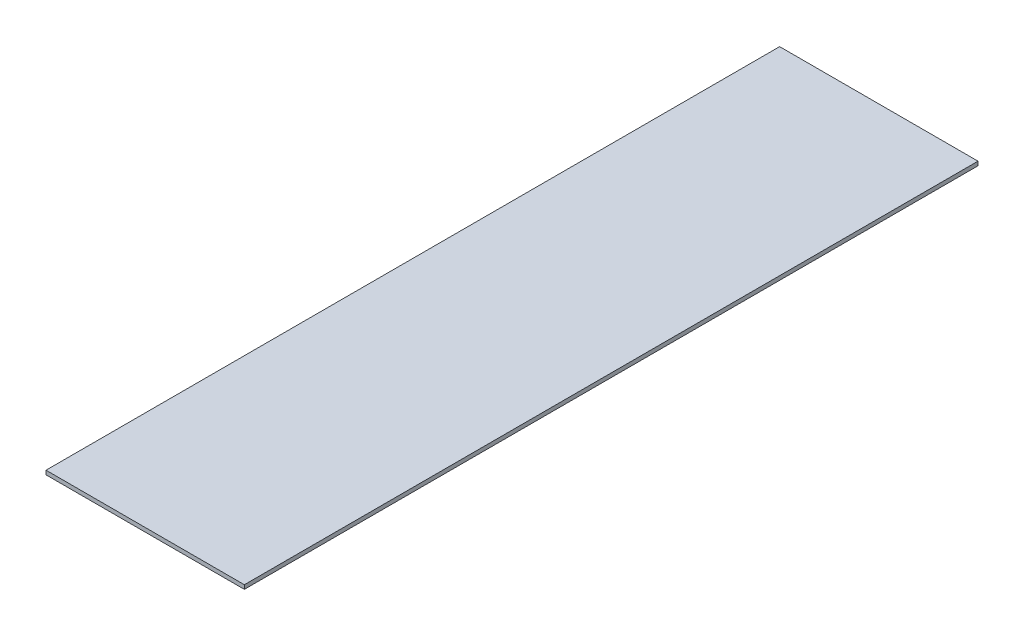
from build123d import *

# Parameters (mm, degrees)
SKETCH1_W           = 24.6054
SKETCH1_H           = 91
BOSS_EXTRUDE1_DEPTH = 0.5


with BuildPart() as part:
    # Sketch1 → Boss-Extrude1 (new body)
    with BuildSketch(Plane(origin=(0, 0, 0), x_dir=(1, 0, 0), z_dir=(0, 1, 0))):
        with Locations((0, 154.629625)):
            Rectangle(SKETCH1_W, SKETCH1_H)
    extrude(amount=BOSS_EXTRUDE1_DEPTH)


solid = part.part
